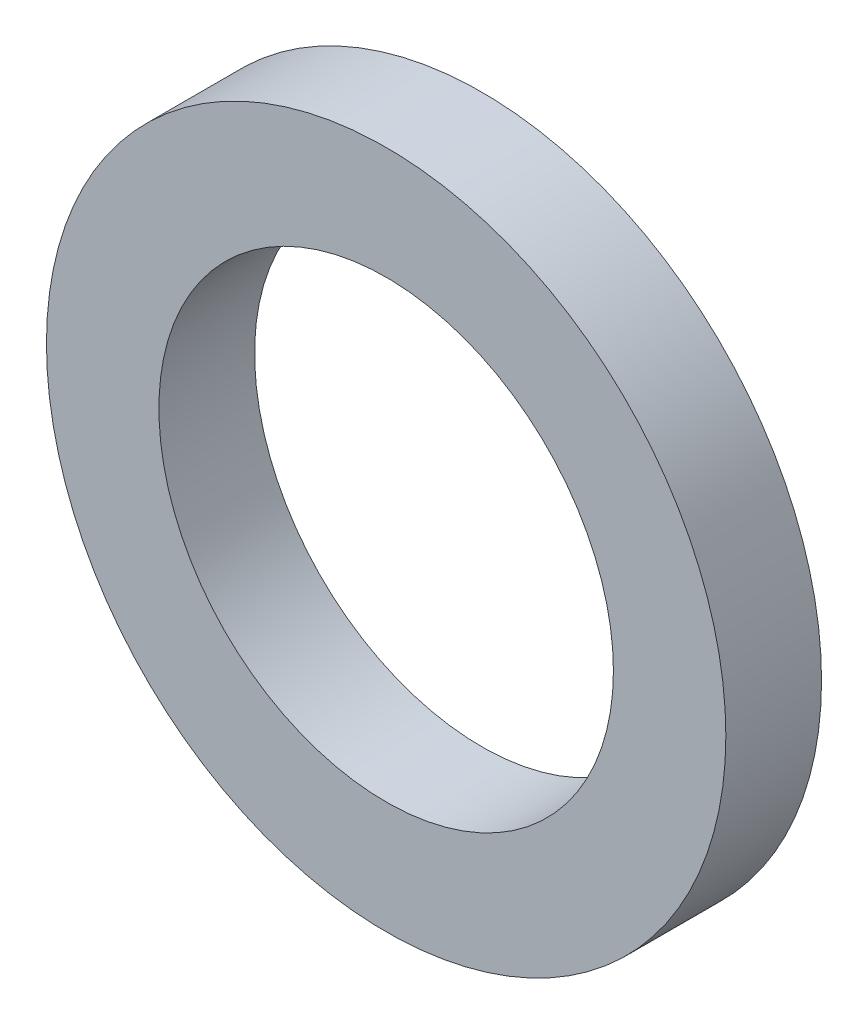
ISO-10303-21;
HEADER;
FILE_DESCRIPTION(('STEP AP214'),'2;1');
FILE_NAME('part.step','',(''),(''),'','','');
FILE_SCHEMA(('AUTOMOTIVE_DESIGN { 1 0 10303 214 1 1 1 1 }'));
ENDSEC;
DATA;
#1=APPLICATION_CONTEXT('core data for automotive mechanical design processes');
#2=APPLICATION_PROTOCOL_DEFINITION('international standard','automotive_design',2000,#1);
#3=PRODUCT_CONTEXT('',#1,'mechanical');
#4=PRODUCT('Part','Part','',(#3));
#5=PRODUCT_RELATED_PRODUCT_CATEGORY('part','',(#4));
#6=PRODUCT_DEFINITION_FORMATION('','',#4);
#7=PRODUCT_DEFINITION_CONTEXT('part definition',#1,'design');
#8=PRODUCT_DEFINITION('design','',#6,#7);
#9=PRODUCT_DEFINITION_SHAPE('','',#8);
#10=(LENGTH_UNIT() NAMED_UNIT(*) SI_UNIT(.MILLI.,.METRE.));
#11=(NAMED_UNIT(*) PLANE_ANGLE_UNIT() SI_UNIT($,.RADIAN.));
#12=(NAMED_UNIT(*) SI_UNIT($,.STERADIAN.) SOLID_ANGLE_UNIT());
#13=UNCERTAINTY_MEASURE_WITH_UNIT(LENGTH_MEASURE(1.E-05),#10,'distance_accuracy_value','');
#14=(GEOMETRIC_REPRESENTATION_CONTEXT(3) GLOBAL_UNCERTAINTY_ASSIGNED_CONTEXT((#13)) GLOBAL_UNIT_ASSIGNED_CONTEXT((#10,
#11,#12)) REPRESENTATION_CONTEXT('',''));
#15=CARTESIAN_POINT('',(0.,0.,0.));
#16=DIRECTION('',(0.,0.,1.));
#17=DIRECTION('',(1.,0.,0.));
#18=AXIS2_PLACEMENT_3D('',#15,#16,#17);
#19=CARTESIAN_POINT('',(0.,0.,2.));
#20=DIRECTION('',(0.,0.,1.));
#21=DIRECTION('',(1.,0.,0.));
#22=AXIS2_PLACEMENT_3D('',#19,#20,#21);
#23=PLANE('',#22);
#24=CARTESIAN_POINT('',(0.,0.,2.));
#25=DIRECTION('',(0.,0.,1.));
#26=DIRECTION('',(1.,0.,0.));
#27=AXIS2_PLACEMENT_3D('',#24,#25,#26);
#28=CIRCLE('',#27,7.1);
#29=CARTESIAN_POINT('',(7.1,0.,2.));
#30=VERTEX_POINT('',#29);
#31=EDGE_CURVE('E10',#30,#30,#28,.T.);
#32=ORIENTED_EDGE('',*,*,#31,.T.);
#33=EDGE_LOOP('',(#32));
#34=FACE_BOUND('',#33,.T.);
#35=CARTESIAN_POINT('',(0.,0.,2.));
#36=DIRECTION('',(0.,0.,1.));
#37=DIRECTION('',(1.,0.,0.));
#38=AXIS2_PLACEMENT_3D('',#35,#36,#37);
#39=CIRCLE('',#38,4.75);
#40=CARTESIAN_POINT('',(4.75,0.,2.));
#41=VERTEX_POINT('',#40);
#42=EDGE_CURVE('E50',#41,#41,#39,.T.);
#43=ORIENTED_EDGE('',*,*,#42,.F.);
#44=EDGE_LOOP('',(#43));
#45=FACE_BOUND('',#44,.T.);
#46=ADVANCED_FACE('F35',(#34,#45),#23,.T.);
#47=CARTESIAN_POINT('',(0.,0.,0.));
#48=DIRECTION('',(0.,0.,1.));
#49=DIRECTION('',(1.,0.,0.));
#50=AXIS2_PLACEMENT_3D('',#47,#48,#49);
#51=PLANE('',#50);
#52=CARTESIAN_POINT('',(0.,0.,0.));
#53=DIRECTION('',(0.,0.,1.));
#54=DIRECTION('',(1.,0.,0.));
#55=AXIS2_PLACEMENT_3D('',#52,#53,#54);
#56=CIRCLE('',#55,7.1);
#57=CARTESIAN_POINT('',(7.1,0.,0.));
#58=VERTEX_POINT('',#57);
#59=EDGE_CURVE('E43',#58,#58,#56,.T.);
#60=ORIENTED_EDGE('',*,*,#59,.F.);
#61=EDGE_LOOP('',(#60));
#62=FACE_BOUND('',#61,.T.);
#63=CARTESIAN_POINT('',(0.,0.,0.));
#64=DIRECTION('',(0.,0.,1.));
#65=DIRECTION('',(1.,0.,0.));
#66=AXIS2_PLACEMENT_3D('',#63,#64,#65);
#67=CIRCLE('',#66,4.75);
#68=CARTESIAN_POINT('',(4.75,0.,0.));
#69=VERTEX_POINT('',#68);
#70=EDGE_CURVE('E54',#69,#69,#67,.T.);
#71=ORIENTED_EDGE('',*,*,#70,.T.);
#72=EDGE_LOOP('',(#71));
#73=FACE_BOUND('',#72,.T.);
#74=ADVANCED_FACE('F60',(#62,#73),#51,.F.);
#75=CARTESIAN_POINT('',(0.,0.,2.));
#76=DIRECTION('',(0.,0.,-1.));
#77=DIRECTION('',(-1.,0.,0.));
#78=AXIS2_PLACEMENT_3D('',#75,#76,#77);
#79=CYLINDRICAL_SURFACE('',#78,7.1);
#80=ORIENTED_EDGE('',*,*,#31,.F.);
#81=EDGE_LOOP('',(#80));
#82=FACE_BOUND('',#81,.T.);
#83=ORIENTED_EDGE('',*,*,#59,.T.);
#84=EDGE_LOOP('',(#83));
#85=FACE_BOUND('',#84,.T.);
#86=ADVANCED_FACE('F37',(#82,#85),#79,.T.);
#87=CARTESIAN_POINT('',(0.,0.,2.));
#88=DIRECTION('',(0.,0.,-1.));
#89=DIRECTION('',(-1.,0.,0.));
#90=AXIS2_PLACEMENT_3D('',#87,#88,#89);
#91=CYLINDRICAL_SURFACE('',#90,4.75);
#92=ORIENTED_EDGE('',*,*,#42,.T.);
#93=EDGE_LOOP('',(#92));
#94=FACE_BOUND('',#93,.T.);
#95=ORIENTED_EDGE('',*,*,#70,.F.);
#96=EDGE_LOOP('',(#95));
#97=FACE_BOUND('',#96,.T.);
#98=ADVANCED_FACE('F62',(#94,#97),#91,.F.);
#99=CLOSED_SHELL('',(#46,#74,#86,#98));
#100=MANIFOLD_SOLID_BREP('B2',#99);
#101=ADVANCED_BREP_SHAPE_REPRESENTATION('',(#18,#100),#14);
#102=SHAPE_DEFINITION_REPRESENTATION(#9,#101);
ENDSEC;
END-ISO-10303-21;
